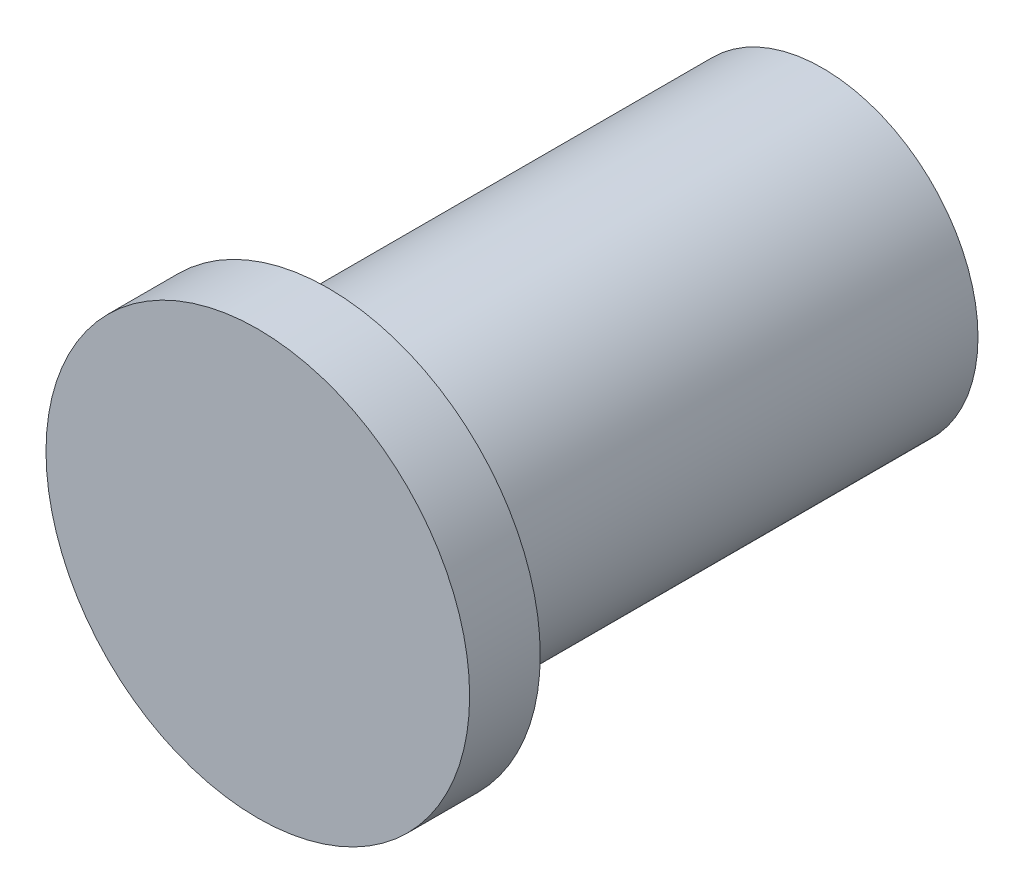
ISO-10303-21;
HEADER;
FILE_DESCRIPTION(('STEP AP214'),'2;1');
FILE_NAME('part.step','',(''),(''),'','','');
FILE_SCHEMA(('AUTOMOTIVE_DESIGN { 1 0 10303 214 1 1 1 1 }'));
ENDSEC;
DATA;
#1=APPLICATION_CONTEXT('core data for automotive mechanical design processes');
#2=APPLICATION_PROTOCOL_DEFINITION('international standard','automotive_design',2000,#1);
#3=PRODUCT_CONTEXT('',#1,'mechanical');
#4=PRODUCT('Part','Part','',(#3));
#5=PRODUCT_RELATED_PRODUCT_CATEGORY('part','',(#4));
#6=PRODUCT_DEFINITION_FORMATION('','',#4);
#7=PRODUCT_DEFINITION_CONTEXT('part definition',#1,'design');
#8=PRODUCT_DEFINITION('design','',#6,#7);
#9=PRODUCT_DEFINITION_SHAPE('','',#8);
#10=(LENGTH_UNIT() NAMED_UNIT(*) SI_UNIT(.MILLI.,.METRE.));
#11=(NAMED_UNIT(*) PLANE_ANGLE_UNIT() SI_UNIT($,.RADIAN.));
#12=(NAMED_UNIT(*) SI_UNIT($,.STERADIAN.) SOLID_ANGLE_UNIT());
#13=UNCERTAINTY_MEASURE_WITH_UNIT(LENGTH_MEASURE(1.E-05),#10,'distance_accuracy_value','');
#14=(GEOMETRIC_REPRESENTATION_CONTEXT(3) GLOBAL_UNCERTAINTY_ASSIGNED_CONTEXT((#13)) GLOBAL_UNIT_ASSIGNED_CONTEXT((#10,
#11,#12)) REPRESENTATION_CONTEXT('',''));
#15=CARTESIAN_POINT('',(0.,0.,0.));
#16=DIRECTION('',(0.,0.,1.));
#17=DIRECTION('',(1.,0.,0.));
#18=AXIS2_PLACEMENT_3D('',#15,#16,#17);
#19=CARTESIAN_POINT('',(0.,0.,44.45));
#20=DIRECTION('',(0.,0.,-1.));
#21=DIRECTION('',(-1.,0.,0.));
#22=AXIS2_PLACEMENT_3D('',#19,#20,#21);
#23=CYLINDRICAL_SURFACE('',#22,13.97);
#24=CARTESIAN_POINT('',(0.,0.,44.45));
#25=DIRECTION('',(0.,0.,1.));
#26=DIRECTION('',(1.,0.,0.));
#27=AXIS2_PLACEMENT_3D('',#24,#25,#26);
#28=CIRCLE('',#27,13.97);
#29=CARTESIAN_POINT('',(13.97,0.,44.45));
#30=VERTEX_POINT('',#29);
#31=EDGE_CURVE('E10',#30,#30,#28,.T.);
#32=ORIENTED_EDGE('',*,*,#31,.F.);
#33=EDGE_LOOP('',(#32));
#34=FACE_BOUND('',#33,.T.);
#35=CARTESIAN_POINT('',(0.,0.,0.));
#36=DIRECTION('',(0.,0.,1.));
#37=DIRECTION('',(1.,0.,0.));
#38=AXIS2_PLACEMENT_3D('',#35,#36,#37);
#39=CIRCLE('',#38,13.97);
#40=CARTESIAN_POINT('',(13.97,0.,0.));
#41=VERTEX_POINT('',#40);
#42=EDGE_CURVE('E40',#41,#41,#39,.T.);
#43=ORIENTED_EDGE('',*,*,#42,.T.);
#44=EDGE_LOOP('',(#43));
#45=FACE_BOUND('',#44,.T.);
#46=ADVANCED_FACE('F37',(#34,#45),#23,.T.);
#47=CARTESIAN_POINT('',(0.,0.,0.));
#48=DIRECTION('',(0.,0.,1.));
#49=DIRECTION('',(1.,0.,0.));
#50=AXIS2_PLACEMENT_3D('',#47,#48,#49);
#51=PLANE('',#50);
#52=ORIENTED_EDGE('',*,*,#42,.F.);
#53=EDGE_LOOP('',(#52));
#54=FACE_BOUND('',#53,.T.);
#55=ADVANCED_FACE('F60',(#54),#51,.F.);
#56=CARTESIAN_POINT('',(0.,0.,50.8));
#57=DIRECTION('',(0.,0.,-1.));
#58=DIRECTION('',(-1.,0.,0.));
#59=AXIS2_PLACEMENT_3D('',#56,#57,#58);
#60=CYLINDRICAL_SURFACE('',#59,19.05);
#61=CARTESIAN_POINT('',(0.,0.,50.8));
#62=DIRECTION('',(0.,0.,1.));
#63=DIRECTION('',(1.,0.,0.));
#64=AXIS2_PLACEMENT_3D('',#61,#62,#63);
#65=CIRCLE('',#64,19.05);
#66=CARTESIAN_POINT('',(19.05,0.,50.8));
#67=VERTEX_POINT('',#66);
#68=EDGE_CURVE('E47',#67,#67,#65,.T.);
#69=ORIENTED_EDGE('',*,*,#68,.F.);
#70=EDGE_LOOP('',(#69));
#71=FACE_BOUND('',#70,.T.);
#72=CARTESIAN_POINT('',(0.,0.,44.45));
#73=DIRECTION('',(0.,0.,1.));
#74=DIRECTION('',(1.,0.,0.));
#75=AXIS2_PLACEMENT_3D('',#72,#73,#74);
#76=CIRCLE('',#75,19.05);
#77=CARTESIAN_POINT('',(19.05,0.,44.45));
#78=VERTEX_POINT('',#77);
#79=EDGE_CURVE('E49',#78,#78,#76,.T.);
#80=ORIENTED_EDGE('',*,*,#79,.T.);
#81=EDGE_LOOP('',(#80));
#82=FACE_BOUND('',#81,.T.);
#83=ADVANCED_FACE('F57',(#71,#82),#60,.T.);
#84=CARTESIAN_POINT('',(0.,0.,50.8));
#85=DIRECTION('',(0.,0.,1.));
#86=DIRECTION('',(1.,0.,0.));
#87=AXIS2_PLACEMENT_3D('',#84,#85,#86);
#88=PLANE('',#87);
#89=ORIENTED_EDGE('',*,*,#68,.T.);
#90=EDGE_LOOP('',(#89));
#91=FACE_BOUND('',#90,.T.);
#92=ADVANCED_FACE('F55',(#91),#88,.T.);
#93=CARTESIAN_POINT('',(0.,0.,44.45));
#94=DIRECTION('',(0.,0.,1.));
#95=DIRECTION('',(1.,0.,0.));
#96=AXIS2_PLACEMENT_3D('',#93,#94,#95);
#97=PLANE('',#96);
#98=ORIENTED_EDGE('',*,*,#31,.T.);
#99=EDGE_LOOP('',(#98));
#100=FACE_BOUND('',#99,.T.);
#101=ORIENTED_EDGE('',*,*,#79,.F.);
#102=EDGE_LOOP('',(#101));
#103=FACE_BOUND('',#102,.T.);
#104=ADVANCED_FACE('F64',(#100,#103),#97,.F.);
#105=CLOSED_SHELL('',(#46,#55,#83,#92,#104));
#106=MANIFOLD_SOLID_BREP('B2',#105);
#107=ADVANCED_BREP_SHAPE_REPRESENTATION('',(#18,#106),#14);
#108=SHAPE_DEFINITION_REPRESENTATION(#9,#107);
ENDSEC;
END-ISO-10303-21;
